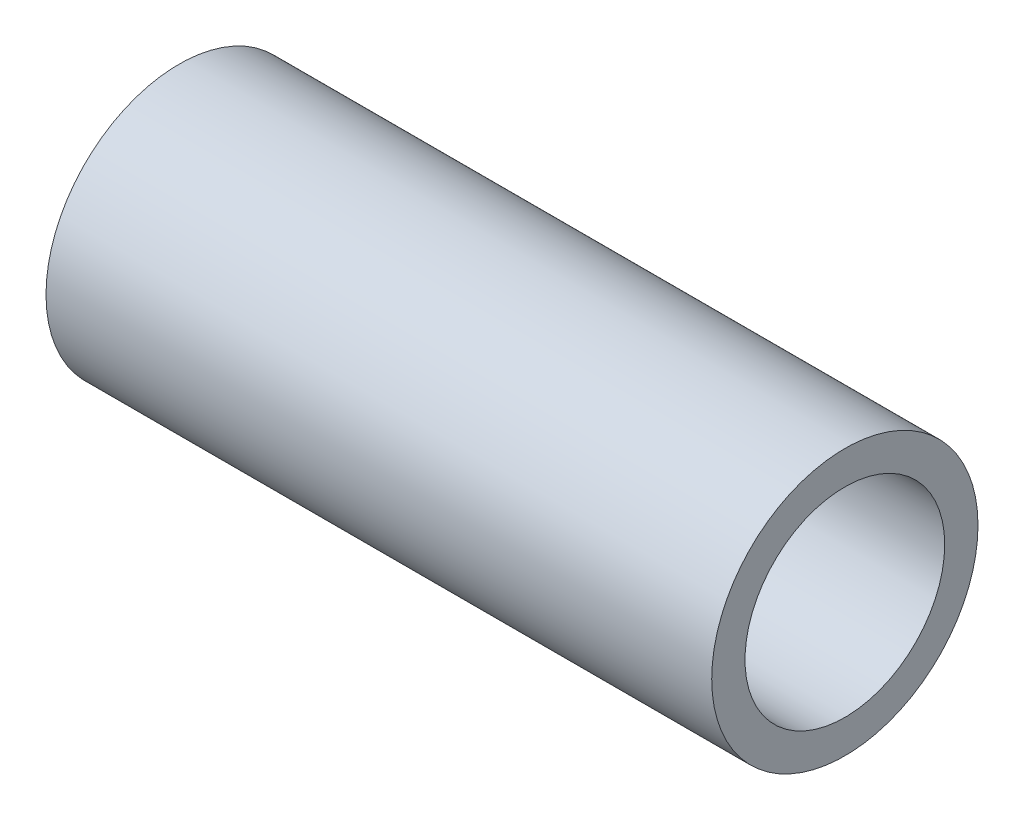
ISO-10303-21;
HEADER;
FILE_DESCRIPTION(('STEP AP214'),'2;1');
FILE_NAME('part.step','',(''),(''),'','','');
FILE_SCHEMA(('AUTOMOTIVE_DESIGN { 1 0 10303 214 1 1 1 1 }'));
ENDSEC;
DATA;
#1=APPLICATION_CONTEXT('core data for automotive mechanical design processes');
#2=APPLICATION_PROTOCOL_DEFINITION('international standard','automotive_design',2000,#1);
#3=PRODUCT_CONTEXT('',#1,'mechanical');
#4=PRODUCT('Part','Part','',(#3));
#5=PRODUCT_RELATED_PRODUCT_CATEGORY('part','',(#4));
#6=PRODUCT_DEFINITION_FORMATION('','',#4);
#7=PRODUCT_DEFINITION_CONTEXT('part definition',#1,'design');
#8=PRODUCT_DEFINITION('design','',#6,#7);
#9=PRODUCT_DEFINITION_SHAPE('','',#8);
#10=(LENGTH_UNIT() NAMED_UNIT(*) SI_UNIT(.MILLI.,.METRE.));
#11=(NAMED_UNIT(*) PLANE_ANGLE_UNIT() SI_UNIT($,.RADIAN.));
#12=(NAMED_UNIT(*) SI_UNIT($,.STERADIAN.) SOLID_ANGLE_UNIT());
#13=UNCERTAINTY_MEASURE_WITH_UNIT(LENGTH_MEASURE(1.E-05),#10,'distance_accuracy_value','');
#14=(GEOMETRIC_REPRESENTATION_CONTEXT(3) GLOBAL_UNCERTAINTY_ASSIGNED_CONTEXT((#13)) GLOBAL_UNIT_ASSIGNED_CONTEXT((#10,
#11,#12)) REPRESENTATION_CONTEXT('',''));
#15=CARTESIAN_POINT('',(0.,0.,0.));
#16=DIRECTION('',(0.,0.,1.));
#17=DIRECTION('',(1.,0.,0.));
#18=AXIS2_PLACEMENT_3D('',#15,#16,#17);
#19=CARTESIAN_POINT('',(30.,0.,0.));
#20=DIRECTION('',(1.,0.,0.));
#21=DIRECTION('',(0.,0.,-1.));
#22=AXIS2_PLACEMENT_3D('',#19,#20,#21);
#23=PLANE('',#22);
#24=CARTESIAN_POINT('',(30.,0.,0.));
#25=DIRECTION('',(1.,0.,0.));
#26=DIRECTION('',(0.,0.,-1.));
#27=AXIS2_PLACEMENT_3D('',#24,#25,#26);
#28=CIRCLE('',#27,12.);
#29=CARTESIAN_POINT('',(30.,0.,-12.));
#30=VERTEX_POINT('',#29);
#31=EDGE_CURVE('E10',#30,#30,#28,.T.);
#32=ORIENTED_EDGE('',*,*,#31,.T.);
#33=EDGE_LOOP('',(#32));
#34=FACE_BOUND('',#33,.T.);
#35=CARTESIAN_POINT('',(30.,0.,0.));
#36=DIRECTION('',(1.,0.,0.));
#37=DIRECTION('',(0.,0.,-1.));
#38=AXIS2_PLACEMENT_3D('',#35,#36,#37);
#39=CIRCLE('',#38,9.);
#40=CARTESIAN_POINT('',(30.,0.,-9.));
#41=VERTEX_POINT('',#40);
#42=EDGE_CURVE('E41',#41,#41,#39,.T.);
#43=ORIENTED_EDGE('',*,*,#42,.F.);
#44=EDGE_LOOP('',(#43));
#45=FACE_BOUND('',#44,.T.);
#46=ADVANCED_FACE('F30',(#34,#45),#23,.T.);
#47=CARTESIAN_POINT('',(-30.,0.,0.));
#48=DIRECTION('',(1.,0.,0.));
#49=DIRECTION('',(0.,0.,-1.));
#50=AXIS2_PLACEMENT_3D('',#47,#48,#49);
#51=PLANE('',#50);
#52=CARTESIAN_POINT('',(-30.,0.,0.));
#53=DIRECTION('',(1.,0.,0.));
#54=DIRECTION('',(0.,0.,-1.));
#55=AXIS2_PLACEMENT_3D('',#52,#53,#54);
#56=CIRCLE('',#55,12.);
#57=CARTESIAN_POINT('',(-30.,0.,-12.));
#58=VERTEX_POINT('',#57);
#59=EDGE_CURVE('E34',#58,#58,#56,.T.);
#60=ORIENTED_EDGE('',*,*,#59,.F.);
#61=EDGE_LOOP('',(#60));
#62=FACE_BOUND('',#61,.T.);
#63=CARTESIAN_POINT('',(-30.,0.,0.));
#64=DIRECTION('',(1.,0.,0.));
#65=DIRECTION('',(0.,0.,-1.));
#66=AXIS2_PLACEMENT_3D('',#63,#64,#65);
#67=CIRCLE('',#66,9.);
#68=CARTESIAN_POINT('',(-30.,0.,-9.));
#69=VERTEX_POINT('',#68);
#70=EDGE_CURVE('E43',#69,#69,#67,.T.);
#71=ORIENTED_EDGE('',*,*,#70,.T.);
#72=EDGE_LOOP('',(#71));
#73=FACE_BOUND('',#72,.T.);
#74=ADVANCED_FACE('F53',(#62,#73),#51,.F.);
#75=CARTESIAN_POINT('',(30.,0.,0.));
#76=DIRECTION('',(-1.,0.,0.));
#77=DIRECTION('',(0.,0.,1.));
#78=AXIS2_PLACEMENT_3D('',#75,#76,#77);
#79=CYLINDRICAL_SURFACE('',#78,12.);
#80=ORIENTED_EDGE('',*,*,#31,.F.);
#81=EDGE_LOOP('',(#80));
#82=FACE_BOUND('',#81,.T.);
#83=ORIENTED_EDGE('',*,*,#59,.T.);
#84=EDGE_LOOP('',(#83));
#85=FACE_BOUND('',#84,.T.);
#86=ADVANCED_FACE('F32',(#82,#85),#79,.T.);
#87=CARTESIAN_POINT('',(30.,0.,0.));
#88=DIRECTION('',(-1.,0.,0.));
#89=DIRECTION('',(0.,0.,1.));
#90=AXIS2_PLACEMENT_3D('',#87,#88,#89);
#91=CYLINDRICAL_SURFACE('',#90,9.);
#92=ORIENTED_EDGE('',*,*,#42,.T.);
#93=EDGE_LOOP('',(#92));
#94=FACE_BOUND('',#93,.T.);
#95=ORIENTED_EDGE('',*,*,#70,.F.);
#96=EDGE_LOOP('',(#95));
#97=FACE_BOUND('',#96,.T.);
#98=ADVANCED_FACE('F49',(#94,#97),#91,.F.);
#99=CLOSED_SHELL('',(#46,#74,#86,#98));
#100=MANIFOLD_SOLID_BREP('B2',#99);
#101=ADVANCED_BREP_SHAPE_REPRESENTATION('',(#18,#100),#14);
#102=SHAPE_DEFINITION_REPRESENTATION(#9,#101);
ENDSEC;
END-ISO-10303-21;
